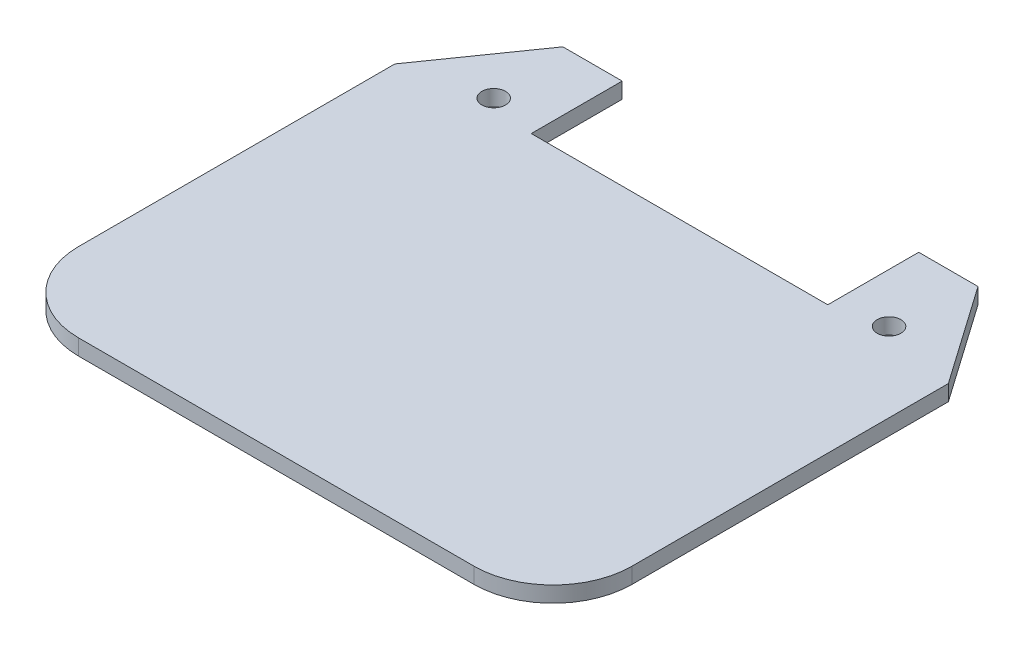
from build123d import *

# Parameters (mm, degrees)
EXTRUDE_1_DEPTH     = 0.4
SKETCH_2_R          = 0.3
SKETCH_2_W          = 7.5
SKETCH_2_H          = 2.3
CUT_EXTRUDE_1_DEPTH = 10
FILLET_1_R          = 2


with BuildPart() as part:
    # Sketch 1 → Extrude 1 (new body)
    with BuildSketch(Plane(origin=(0, 0, 0), x_dir=(1, 0, 0), z_dir=(0, 1, 0))):
        Polygon((7, 3.75), (5.249481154, 6.25), (-5.249481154, 6.25), (-7, 3.75), (-7, -6.25), (7, -6.25), align=None)
    extrude(amount=EXTRUDE_1_DEPTH)

    # Sketch 2 → Cut-Extrude 1 (cut)
    with BuildSketch(Plane(origin=(0, 0.4, 0), x_dir=(1, 0, 0), z_dir=(0, 1, 0))):
        with Locations(Location((-5, 4.25, 0), (0, 0, 270))):
            Circle(SKETCH_2_R)
        with Locations(Location((5, 4.25, 0), (0, 0, 270))):
            Circle(SKETCH_2_R)
        with Locations((0, 5.1)):
            Rectangle(SKETCH_2_W, SKETCH_2_H)
    extrude(amount=-CUT_EXTRUDE_1_DEPTH, mode=Mode.SUBTRACT)

    # Fillet 1
    fillet_1_edges = [part.edges().sort_by_distance(p)[0] for p in [
        (7, 0.2, 6.25),
        (-7, 0.2, 6.25),
    ]]
    fillet(fillet_1_edges, radius=FILLET_1_R)


solid = part.part
